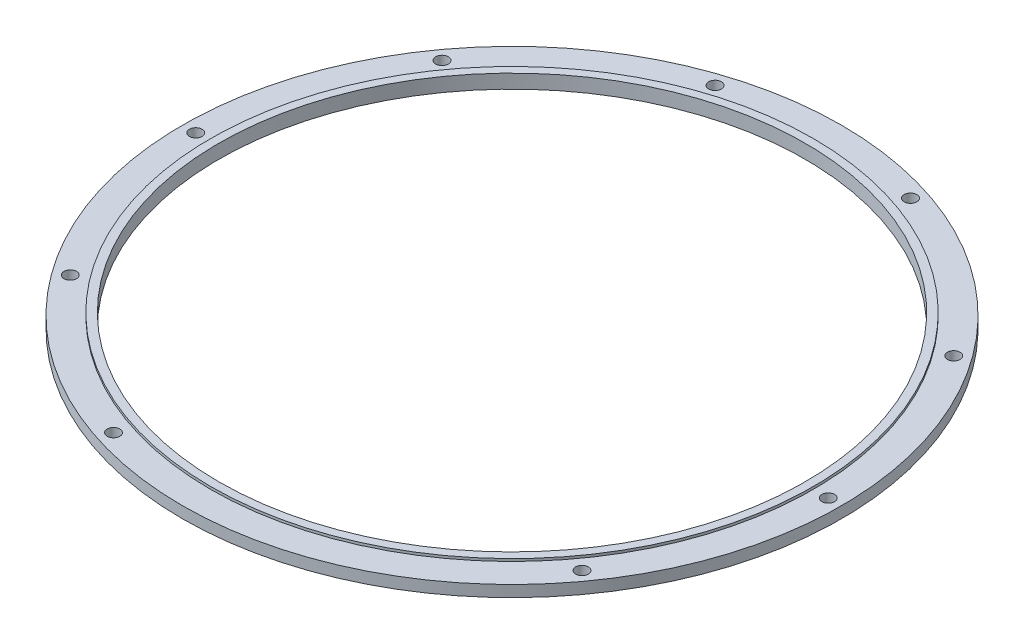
from build123d import *

# Parameters (mm, degrees)
F_30_0_1285_DIAMETER_HOLE1_D = 3.2639
CIRPATTERN1_COUNT            = 10
SKETCH6_R                    = 77.6
SKETCH6_R_2                  = 75.5
EXTRUDE1_DEPTH               = 0.15


with BuildPart() as part:
    # Sketch1 → Revolve1 (revolve)
    with BuildSketch(Plane.XY, mode=Mode.PRIVATE) as revolve1_sk:
        Polygon((84.858, 0), (84.858, -19.700999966), (75.5, -19.700999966), (75.5, -16.271999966), (78, -16.271999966), (78, -8.271999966), (75.5, -8.271999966), (75.5, 0), align=None)
    revolve(revolve1_sk.sketch.rotate(Axis((0, 0, 0), (0, -1, 0)), 90), axis=Axis((0, 0, 0), (0, -1, 0)))

    # 30 _0.1285_ Diameter Hole1 (through all)
    with Locations(Plane.XZ.offset(19.700999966)):
        with Locations((-25.162944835, -77.443581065)):
            f_30_0_1285_diameter_hole1 = Hole(F_30_0_1285_DIAMETER_HOLE1_D / 2)

    # CirPattern1: 30 _0.1285_ Diameter Hole1 ×10 about axis, 1 skipped
    cirpattern1_axis = Axis((0, 0, 0), (0, -1, 0))
    add([f_30_0_1285_diameter_hole1.rotate(cirpattern1_axis, i * 360 / CIRPATTERN1_COUNT) for i in range(1, CIRPATTERN1_COUNT) if i not in (5,)], mode=Mode.SUBTRACT)

    # Sketch5 → Cut-Revolve1 (revolve, cut)
    with BuildSketch(Plane.XY, mode=Mode.PRIVATE) as cut_revolve1_sk:
        Polygon((77.6, -16.271999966), (77.6, -16.771999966), (84.865898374, -16.771999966), (84.865898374, 2.012e-06), (75.5, 2.012e-06), (75.5, -16.271999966), align=None)
    revolve(cut_revolve1_sk.sketch.rotate(Axis((0, 0, 0), (0, -1, 0)), 90), axis=Axis((0, 0, 0), (0, -1, 0)), mode=Mode.SUBTRACT)

    # Sketch6 → Extrude1 (add)
    with BuildSketch(Plane(origin=(0, -16.271999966, 0), x_dir=(-1, 0, 0), z_dir=(0, 1, 0))):
        with Locations(Location((0, 0, 0), (0, 0, 90))):
            Circle(SKETCH6_R)
        with Locations(Location((0, 0, 0), (0, 0, 90))):
            Circle(SKETCH6_R_2, mode=Mode.SUBTRACT)
    extrude(amount=EXTRUDE1_DEPTH)


solid = part.part
